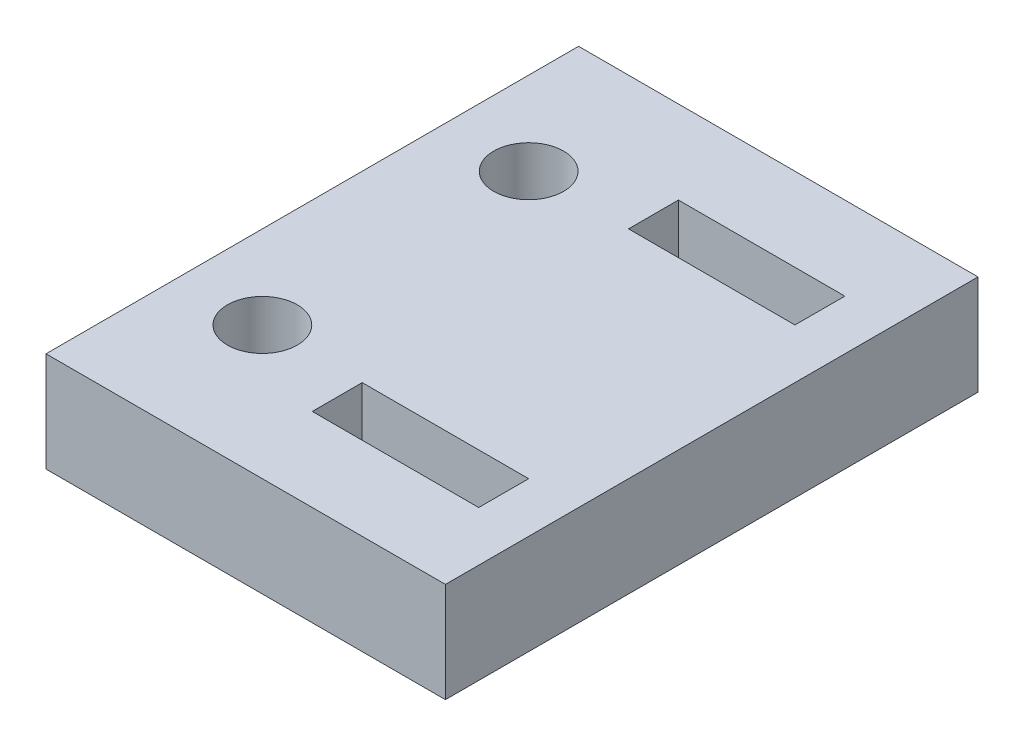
ISO-10303-21;
HEADER;
FILE_DESCRIPTION(('STEP AP214'),'2;1');
FILE_NAME('part.step','',(''),(''),'','','');
FILE_SCHEMA(('AUTOMOTIVE_DESIGN { 1 0 10303 214 1 1 1 1 }'));
ENDSEC;
DATA;
#1=APPLICATION_CONTEXT('core data for automotive mechanical design processes');
#2=APPLICATION_PROTOCOL_DEFINITION('international standard','automotive_design',2000,#1);
#3=PRODUCT_CONTEXT('',#1,'mechanical');
#4=PRODUCT('Part','Part','',(#3));
#5=PRODUCT_RELATED_PRODUCT_CATEGORY('part','',(#4));
#6=PRODUCT_DEFINITION_FORMATION('','',#4);
#7=PRODUCT_DEFINITION_CONTEXT('part definition',#1,'design');
#8=PRODUCT_DEFINITION('design','',#6,#7);
#9=PRODUCT_DEFINITION_SHAPE('','',#8);
#10=(LENGTH_UNIT() NAMED_UNIT(*) SI_UNIT(.MILLI.,.METRE.));
#11=(NAMED_UNIT(*) PLANE_ANGLE_UNIT() SI_UNIT($,.RADIAN.));
#12=(NAMED_UNIT(*) SI_UNIT($,.STERADIAN.) SOLID_ANGLE_UNIT());
#13=UNCERTAINTY_MEASURE_WITH_UNIT(LENGTH_MEASURE(1.E-05),#10,'distance_accuracy_value','');
#14=(GEOMETRIC_REPRESENTATION_CONTEXT(3) GLOBAL_UNCERTAINTY_ASSIGNED_CONTEXT((#13)) GLOBAL_UNIT_ASSIGNED_CONTEXT((#10,
#11,#12)) REPRESENTATION_CONTEXT('',''));
#15=CARTESIAN_POINT('',(0.,0.,0.));
#16=DIRECTION('',(0.,0.,1.));
#17=DIRECTION('',(1.,0.,0.));
#18=AXIS2_PLACEMENT_3D('',#15,#16,#17);
#19=CARTESIAN_POINT('',(0.,6.,0.));
#20=DIRECTION('',(0.,1.,0.));
#21=DIRECTION('',(0.,0.,1.));
#22=AXIS2_PLACEMENT_3D('',#19,#20,#21);
#23=PLANE('',#22);
#24=CARTESIAN_POINT('',(5.,6.,8.));
#25=DIRECTION('',(0.,1.,0.));
#26=DIRECTION('',(0.,0.,1.));
#27=AXIS2_PLACEMENT_3D('',#24,#25,#26);
#28=CIRCLE('',#27,2.1);
#29=CARTESIAN_POINT('',(5.,6.,10.1));
#30=VERTEX_POINT('',#29);
#31=EDGE_CURVE('E197',#30,#30,#28,.T.);
#32=ORIENTED_EDGE('',*,*,#31,.F.);
#33=EDGE_LOOP('',(#32));
#34=FACE_BOUND('',#33,.T.);
#35=DIRECTION('',(0.,0.,1.));
#36=VECTOR('',#35,1.);
#37=CARTESIAN_POINT('',(0.,6.,0.));
#38=LINE('',#37,#36);
#39=CARTESIAN_POINT('',(0.,6.,0.));
#40=VERTEX_POINT('',#39);
#41=CARTESIAN_POINT('',(0.,6.,32.));
#42=VERTEX_POINT('',#41);
#43=EDGE_CURVE('E203',#40,#42,#38,.T.);
#44=ORIENTED_EDGE('',*,*,#43,.T.);
#45=DIRECTION('',(1.,0.,0.));
#46=VECTOR('',#45,1.);
#47=CARTESIAN_POINT('',(0.,6.,32.));
#48=LINE('',#47,#46);
#49=CARTESIAN_POINT('',(24.,6.,32.));
#50=VERTEX_POINT('',#49);
#51=EDGE_CURVE('E206',#42,#50,#48,.T.);
#52=ORIENTED_EDGE('',*,*,#51,.T.);
#53=DIRECTION('',(0.,0.,-1.));
#54=VECTOR('',#53,1.);
#55=CARTESIAN_POINT('',(24.,6.,0.));
#56=LINE('',#55,#54);
#57=CARTESIAN_POINT('',(24.,6.,0.));
#58=VERTEX_POINT('',#57);
#59=EDGE_CURVE('E209',#50,#58,#56,.T.);
#60=ORIENTED_EDGE('',*,*,#59,.T.);
#61=DIRECTION('',(-1.,0.,0.));
#62=VECTOR('',#61,1.);
#63=CARTESIAN_POINT('',(0.,6.,0.));
#64=LINE('',#63,#62);
#65=EDGE_CURVE('E211',#58,#40,#64,.T.);
#66=ORIENTED_EDGE('',*,*,#65,.T.);
#67=EDGE_LOOP('',(#44,#52,#60,#66));
#68=FACE_BOUND('',#67,.T.);
#69=CARTESIAN_POINT('',(5.,6.,24.));
#70=DIRECTION('',(0.,1.,0.));
#71=DIRECTION('',(0.,0.,1.));
#72=AXIS2_PLACEMENT_3D('',#69,#70,#71);
#73=CIRCLE('',#72,2.1);
#74=CARTESIAN_POINT('',(5.,6.,26.1));
#75=VERTEX_POINT('',#74);
#76=EDGE_CURVE('E191',#75,#75,#73,.T.);
#77=ORIENTED_EDGE('',*,*,#76,.F.);
#78=EDGE_LOOP('',(#77));
#79=FACE_BOUND('',#78,.T.);
#80=DIRECTION('',(1.,0.,0.));
#81=VECTOR('',#80,1.);
#82=CARTESIAN_POINT('',(11.,6.,8.));
#83=LINE('',#82,#81);
#84=CARTESIAN_POINT('',(11.,6.,8.));
#85=VERTEX_POINT('',#84);
#86=CARTESIAN_POINT('',(21.,6.,8.));
#87=VERTEX_POINT('',#86);
#88=EDGE_CURVE('E162',#85,#87,#83,.T.);
#89=ORIENTED_EDGE('',*,*,#88,.F.);
#90=DIRECTION('',(0.,0.,1.));
#91=VECTOR('',#90,1.);
#92=CARTESIAN_POINT('',(11.,6.,5.));
#93=LINE('',#92,#91);
#94=CARTESIAN_POINT('',(11.,6.,5.));
#95=VERTEX_POINT('',#94);
#96=EDGE_CURVE('E160',#95,#85,#93,.T.);
#97=ORIENTED_EDGE('',*,*,#96,.F.);
#98=DIRECTION('',(-1.,0.,0.));
#99=VECTOR('',#98,1.);
#100=CARTESIAN_POINT('',(11.,6.,5.));
#101=LINE('',#100,#99);
#102=CARTESIAN_POINT('',(21.,6.,5.));
#103=VERTEX_POINT('',#102);
#104=EDGE_CURVE('E168',#103,#95,#101,.T.);
#105=ORIENTED_EDGE('',*,*,#104,.F.);
#106=DIRECTION('',(0.,0.,-1.));
#107=VECTOR('',#106,1.);
#108=CARTESIAN_POINT('',(21.,6.,5.));
#109=LINE('',#108,#107);
#110=EDGE_CURVE('E165',#87,#103,#109,.T.);
#111=ORIENTED_EDGE('',*,*,#110,.F.);
#112=EDGE_LOOP('',(#89,#97,#105,#111));
#113=FACE_BOUND('',#112,.T.);
#114=DIRECTION('',(1.,0.,0.));
#115=VECTOR('',#114,1.);
#116=CARTESIAN_POINT('',(11.,6.,27.));
#117=LINE('',#116,#115);
#118=CARTESIAN_POINT('',(11.,6.,27.));
#119=VERTEX_POINT('',#118);
#120=CARTESIAN_POINT('',(21.,6.,27.));
#121=VERTEX_POINT('',#120);
#122=EDGE_CURVE('E132',#119,#121,#117,.T.);
#123=ORIENTED_EDGE('',*,*,#122,.F.);
#124=DIRECTION('',(0.,0.,1.));
#125=VECTOR('',#124,1.);
#126=CARTESIAN_POINT('',(11.,6.,24.));
#127=LINE('',#126,#125);
#128=CARTESIAN_POINT('',(11.,6.,24.));
#129=VERTEX_POINT('',#128);
#130=EDGE_CURVE('E124',#129,#119,#127,.T.);
#131=ORIENTED_EDGE('',*,*,#130,.F.);
#132=DIRECTION('',(-1.,0.,0.));
#133=VECTOR('',#132,1.);
#134=CARTESIAN_POINT('',(11.,6.,24.));
#135=LINE('',#134,#133);
#136=CARTESIAN_POINT('',(21.,6.,24.));
#137=VERTEX_POINT('',#136);
#138=EDGE_CURVE('E146',#137,#129,#135,.T.);
#139=ORIENTED_EDGE('',*,*,#138,.F.);
#140=DIRECTION('',(0.,0.,-1.));
#141=VECTOR('',#140,1.);
#142=CARTESIAN_POINT('',(21.,6.,24.));
#143=LINE('',#142,#141);
#144=EDGE_CURVE('E144',#121,#137,#143,.T.);
#145=ORIENTED_EDGE('',*,*,#144,.F.);
#146=EDGE_LOOP('',(#123,#131,#139,#145));
#147=FACE_BOUND('',#146,.T.);
#148=ADVANCED_FACE('F35',(#34,#68,#79,#113,#147),#23,.T.);
#149=CARTESIAN_POINT('',(0.,0.,0.));
#150=DIRECTION('',(0.,1.,0.));
#151=DIRECTION('',(0.,0.,1.));
#152=AXIS2_PLACEMENT_3D('',#149,#150,#151);
#153=PLANE('',#152);
#154=DIRECTION('',(0.,0.,1.));
#155=VECTOR('',#154,1.);
#156=CARTESIAN_POINT('',(11.,0.,5.));
#157=LINE('',#156,#155);
#158=CARTESIAN_POINT('',(11.,0.,5.));
#159=VERTEX_POINT('',#158);
#160=CARTESIAN_POINT('',(11.,0.,8.));
#161=VERTEX_POINT('',#160);
#162=EDGE_CURVE('E140',#159,#161,#157,.T.);
#163=ORIENTED_EDGE('',*,*,#162,.T.);
#164=DIRECTION('',(1.,0.,0.));
#165=VECTOR('',#164,1.);
#166=CARTESIAN_POINT('',(11.,0.,8.));
#167=LINE('',#166,#165);
#168=CARTESIAN_POINT('',(21.,0.,8.));
#169=VERTEX_POINT('',#168);
#170=EDGE_CURVE('E173',#161,#169,#167,.T.);
#171=ORIENTED_EDGE('',*,*,#170,.T.);
#172=DIRECTION('',(0.,0.,-1.));
#173=VECTOR('',#172,1.);
#174=CARTESIAN_POINT('',(21.,0.,5.));
#175=LINE('',#174,#173);
#176=CARTESIAN_POINT('',(21.,0.,5.));
#177=VERTEX_POINT('',#176);
#178=EDGE_CURVE('E176',#169,#177,#175,.T.);
#179=ORIENTED_EDGE('',*,*,#178,.T.);
#180=DIRECTION('',(-1.,0.,0.));
#181=VECTOR('',#180,1.);
#182=CARTESIAN_POINT('',(11.,0.,5.));
#183=LINE('',#182,#181);
#184=EDGE_CURVE('E163',#177,#159,#183,.T.);
#185=ORIENTED_EDGE('',*,*,#184,.T.);
#186=EDGE_LOOP('',(#163,#171,#179,#185));
#187=FACE_BOUND('',#186,.T.);
#188=DIRECTION('',(0.,0.,1.));
#189=VECTOR('',#188,1.);
#190=CARTESIAN_POINT('',(0.,0.,0.));
#191=LINE('',#190,#189);
#192=CARTESIAN_POINT('',(0.,0.,0.));
#193=VERTEX_POINT('',#192);
#194=CARTESIAN_POINT('',(0.,0.,32.));
#195=VERTEX_POINT('',#194);
#196=EDGE_CURVE('E200',#193,#195,#191,.T.);
#197=ORIENTED_EDGE('',*,*,#196,.F.);
#198=DIRECTION('',(-1.,0.,0.));
#199=VECTOR('',#198,1.);
#200=CARTESIAN_POINT('',(0.,0.,0.));
#201=LINE('',#200,#199);
#202=CARTESIAN_POINT('',(24.,0.,0.));
#203=VERTEX_POINT('',#202);
#204=EDGE_CURVE('E207',#203,#193,#201,.T.);
#205=ORIENTED_EDGE('',*,*,#204,.F.);
#206=DIRECTION('',(0.,0.,-1.));
#207=VECTOR('',#206,1.);
#208=CARTESIAN_POINT('',(24.,0.,0.));
#209=LINE('',#208,#207);
#210=CARTESIAN_POINT('',(24.,0.,32.));
#211=VERTEX_POINT('',#210);
#212=EDGE_CURVE('E218',#211,#203,#209,.T.);
#213=ORIENTED_EDGE('',*,*,#212,.F.);
#214=DIRECTION('',(1.,0.,0.));
#215=VECTOR('',#214,1.);
#216=CARTESIAN_POINT('',(0.,0.,32.));
#217=LINE('',#216,#215);
#218=EDGE_CURVE('E216',#195,#211,#217,.T.);
#219=ORIENTED_EDGE('',*,*,#218,.F.);
#220=EDGE_LOOP('',(#197,#205,#213,#219));
#221=FACE_BOUND('',#220,.T.);
#222=CARTESIAN_POINT('',(5.,0.,8.));
#223=DIRECTION('',(0.,1.,0.));
#224=DIRECTION('',(0.,0.,1.));
#225=AXIS2_PLACEMENT_3D('',#222,#223,#224);
#226=CIRCLE('',#225,2.1);
#227=CARTESIAN_POINT('',(5.,0.,10.1));
#228=VERTEX_POINT('',#227);
#229=EDGE_CURVE('E194',#228,#228,#226,.T.);
#230=ORIENTED_EDGE('',*,*,#229,.T.);
#231=EDGE_LOOP('',(#230));
#232=FACE_BOUND('',#231,.T.);
#233=CARTESIAN_POINT('',(5.,0.,24.));
#234=DIRECTION('',(0.,1.,0.));
#235=DIRECTION('',(0.,0.,1.));
#236=AXIS2_PLACEMENT_3D('',#233,#234,#235);
#237=CIRCLE('',#236,2.1);
#238=CARTESIAN_POINT('',(5.,0.,26.1));
#239=VERTEX_POINT('',#238);
#240=EDGE_CURVE('E190',#239,#239,#237,.T.);
#241=ORIENTED_EDGE('',*,*,#240,.T.);
#242=EDGE_LOOP('',(#241));
#243=FACE_BOUND('',#242,.T.);
#244=DIRECTION('',(0.,0.,1.));
#245=VECTOR('',#244,1.);
#246=CARTESIAN_POINT('',(11.,0.,24.));
#247=LINE('',#246,#245);
#248=CARTESIAN_POINT('',(11.,0.,24.));
#249=VERTEX_POINT('',#248);
#250=CARTESIAN_POINT('',(11.,0.,27.));
#251=VERTEX_POINT('',#250);
#252=EDGE_CURVE('E58',#249,#251,#247,.T.);
#253=ORIENTED_EDGE('',*,*,#252,.T.);
#254=DIRECTION('',(1.,0.,0.));
#255=VECTOR('',#254,1.);
#256=CARTESIAN_POINT('',(11.,0.,27.));
#257=LINE('',#256,#255);
#258=CARTESIAN_POINT('',(21.,0.,27.));
#259=VERTEX_POINT('',#258);
#260=EDGE_CURVE('E139',#251,#259,#257,.T.);
#261=ORIENTED_EDGE('',*,*,#260,.T.);
#262=DIRECTION('',(0.,0.,-1.));
#263=VECTOR('',#262,1.);
#264=CARTESIAN_POINT('',(21.,0.,24.));
#265=LINE('',#264,#263);
#266=CARTESIAN_POINT('',(21.,0.,24.));
#267=VERTEX_POINT('',#266);
#268=EDGE_CURVE('E152',#259,#267,#265,.T.);
#269=ORIENTED_EDGE('',*,*,#268,.T.);
#270=DIRECTION('',(-1.,0.,0.));
#271=VECTOR('',#270,1.);
#272=CARTESIAN_POINT('',(11.,0.,24.));
#273=LINE('',#272,#271);
#274=EDGE_CURVE('E133',#267,#249,#273,.T.);
#275=ORIENTED_EDGE('',*,*,#274,.T.);
#276=EDGE_LOOP('',(#253,#261,#269,#275));
#277=FACE_BOUND('',#276,.T.);
#278=ADVANCED_FACE('F236',(#187,#221,#232,#243,#277),#153,.F.);
#279=CARTESIAN_POINT('',(0.,6.,0.));
#280=DIRECTION('',(1.,0.,0.));
#281=DIRECTION('',(0.,0.,-1.));
#282=AXIS2_PLACEMENT_3D('',#279,#280,#281);
#283=PLANE('',#282);
#284=ORIENTED_EDGE('',*,*,#196,.T.);
#285=DIRECTION('',(0.,-1.,0.));
#286=VECTOR('',#285,1.);
#287=CARTESIAN_POINT('',(0.,6.,32.));
#288=LINE('',#287,#286);
#289=EDGE_CURVE('E11',#42,#195,#288,.T.);
#290=ORIENTED_EDGE('',*,*,#289,.F.);
#291=ORIENTED_EDGE('',*,*,#43,.F.);
#292=DIRECTION('',(0.,-1.,0.));
#293=VECTOR('',#292,1.);
#294=CARTESIAN_POINT('',(0.,6.,0.));
#295=LINE('',#294,#293);
#296=EDGE_CURVE('E213',#40,#193,#295,.T.);
#297=ORIENTED_EDGE('',*,*,#296,.T.);
#298=EDGE_LOOP('',(#284,#290,#291,#297));
#299=FACE_BOUND('',#298,.T.);
#300=ADVANCED_FACE('F37',(#299),#283,.F.);
#301=CARTESIAN_POINT('',(0.,6.,32.));
#302=DIRECTION('',(0.,0.,-1.));
#303=DIRECTION('',(-1.,0.,0.));
#304=AXIS2_PLACEMENT_3D('',#301,#302,#303);
#305=PLANE('',#304);
#306=ORIENTED_EDGE('',*,*,#218,.T.);
#307=DIRECTION('',(0.,-1.,0.));
#308=VECTOR('',#307,1.);
#309=CARTESIAN_POINT('',(24.,6.,32.));
#310=LINE('',#309,#308);
#311=EDGE_CURVE('E43',#50,#211,#310,.T.);
#312=ORIENTED_EDGE('',*,*,#311,.F.);
#313=ORIENTED_EDGE('',*,*,#51,.F.);
#314=ORIENTED_EDGE('',*,*,#289,.T.);
#315=EDGE_LOOP('',(#306,#312,#313,#314));
#316=FACE_BOUND('',#315,.T.);
#317=ADVANCED_FACE('F247',(#316),#305,.F.);
#318=CARTESIAN_POINT('',(24.,6.,0.));
#319=DIRECTION('',(-1.,0.,0.));
#320=DIRECTION('',(0.,0.,1.));
#321=AXIS2_PLACEMENT_3D('',#318,#319,#320);
#322=PLANE('',#321);
#323=ORIENTED_EDGE('',*,*,#212,.T.);
#324=DIRECTION('',(0.,-1.,0.));
#325=VECTOR('',#324,1.);
#326=CARTESIAN_POINT('',(24.,6.,0.));
#327=LINE('',#326,#325);
#328=EDGE_CURVE('E223',#58,#203,#327,.T.);
#329=ORIENTED_EDGE('',*,*,#328,.F.);
#330=ORIENTED_EDGE('',*,*,#59,.F.);
#331=ORIENTED_EDGE('',*,*,#311,.T.);
#332=EDGE_LOOP('',(#323,#329,#330,#331));
#333=FACE_BOUND('',#332,.T.);
#334=ADVANCED_FACE('F230',(#333),#322,.F.);
#335=CARTESIAN_POINT('',(0.,6.,0.));
#336=DIRECTION('',(0.,0.,1.));
#337=DIRECTION('',(1.,0.,0.));
#338=AXIS2_PLACEMENT_3D('',#335,#336,#337);
#339=PLANE('',#338);
#340=ORIENTED_EDGE('',*,*,#204,.T.);
#341=ORIENTED_EDGE('',*,*,#296,.F.);
#342=ORIENTED_EDGE('',*,*,#65,.F.);
#343=ORIENTED_EDGE('',*,*,#328,.T.);
#344=EDGE_LOOP('',(#340,#341,#342,#343));
#345=FACE_BOUND('',#344,.T.);
#346=ADVANCED_FACE('F240',(#345),#339,.F.);
#347=CARTESIAN_POINT('',(5.,6.,8.));
#348=DIRECTION('',(0.,-1.,0.));
#349=DIRECTION('',(0.,0.,-1.));
#350=AXIS2_PLACEMENT_3D('',#347,#348,#349);
#351=CYLINDRICAL_SURFACE('',#350,2.1);
#352=ORIENTED_EDGE('',*,*,#31,.T.);
#353=EDGE_LOOP('',(#352));
#354=FACE_BOUND('',#353,.T.);
#355=ORIENTED_EDGE('',*,*,#229,.F.);
#356=EDGE_LOOP('',(#355));
#357=FACE_BOUND('',#356,.T.);
#358=ADVANCED_FACE('F264',(#354,#357),#351,.F.);
#359=CARTESIAN_POINT('',(5.,6.,24.));
#360=DIRECTION('',(0.,-1.,0.));
#361=DIRECTION('',(0.,0.,-1.));
#362=AXIS2_PLACEMENT_3D('',#359,#360,#361);
#363=CYLINDRICAL_SURFACE('',#362,2.1);
#364=ORIENTED_EDGE('',*,*,#76,.T.);
#365=EDGE_LOOP('',(#364));
#366=FACE_BOUND('',#365,.T.);
#367=ORIENTED_EDGE('',*,*,#240,.F.);
#368=EDGE_LOOP('',(#367));
#369=FACE_BOUND('',#368,.T.);
#370=ADVANCED_FACE('F271',(#366,#369),#363,.F.);
#371=CARTESIAN_POINT('',(11.,6.,5.));
#372=DIRECTION('',(1.,0.,0.));
#373=DIRECTION('',(0.,0.,-1.));
#374=AXIS2_PLACEMENT_3D('',#371,#372,#373);
#375=PLANE('',#374);
#376=ORIENTED_EDGE('',*,*,#162,.F.);
#377=DIRECTION('',(0.,-1.,0.));
#378=VECTOR('',#377,1.);
#379=CARTESIAN_POINT('',(11.,6.,5.));
#380=LINE('',#379,#378);
#381=EDGE_CURVE('E170',#95,#159,#380,.T.);
#382=ORIENTED_EDGE('',*,*,#381,.F.);
#383=ORIENTED_EDGE('',*,*,#96,.T.);
#384=DIRECTION('',(0.,-1.,0.));
#385=VECTOR('',#384,1.);
#386=CARTESIAN_POINT('',(11.,6.,8.));
#387=LINE('',#386,#385);
#388=EDGE_CURVE('E187',#85,#161,#387,.T.);
#389=ORIENTED_EDGE('',*,*,#388,.T.);
#390=EDGE_LOOP('',(#376,#382,#383,#389));
#391=FACE_BOUND('',#390,.T.);
#392=ADVANCED_FACE('F276',(#391),#375,.T.);
#393=CARTESIAN_POINT('',(11.,6.,8.));
#394=DIRECTION('',(0.,0.,-1.));
#395=DIRECTION('',(-1.,0.,0.));
#396=AXIS2_PLACEMENT_3D('',#393,#394,#395);
#397=PLANE('',#396);
#398=ORIENTED_EDGE('',*,*,#170,.F.);
#399=ORIENTED_EDGE('',*,*,#388,.F.);
#400=ORIENTED_EDGE('',*,*,#88,.T.);
#401=DIRECTION('',(0.,-1.,0.));
#402=VECTOR('',#401,1.);
#403=CARTESIAN_POINT('',(21.,6.,8.));
#404=LINE('',#403,#402);
#405=EDGE_CURVE('E185',#87,#169,#404,.T.);
#406=ORIENTED_EDGE('',*,*,#405,.T.);
#407=EDGE_LOOP('',(#398,#399,#400,#406));
#408=FACE_BOUND('',#407,.T.);
#409=ADVANCED_FACE('F305',(#408),#397,.T.);
#410=CARTESIAN_POINT('',(21.,6.,5.));
#411=DIRECTION('',(-1.,0.,0.));
#412=DIRECTION('',(0.,0.,1.));
#413=AXIS2_PLACEMENT_3D('',#410,#411,#412);
#414=PLANE('',#413);
#415=ORIENTED_EDGE('',*,*,#178,.F.);
#416=ORIENTED_EDGE('',*,*,#405,.F.);
#417=ORIENTED_EDGE('',*,*,#110,.T.);
#418=DIRECTION('',(0.,-1.,0.));
#419=VECTOR('',#418,1.);
#420=CARTESIAN_POINT('',(21.,6.,5.));
#421=LINE('',#420,#419);
#422=EDGE_CURVE('E183',#103,#177,#421,.T.);
#423=ORIENTED_EDGE('',*,*,#422,.T.);
#424=EDGE_LOOP('',(#415,#416,#417,#423));
#425=FACE_BOUND('',#424,.T.);
#426=ADVANCED_FACE('F301',(#425),#414,.T.);
#427=CARTESIAN_POINT('',(11.,6.,5.));
#428=DIRECTION('',(0.,0.,1.));
#429=DIRECTION('',(1.,0.,0.));
#430=AXIS2_PLACEMENT_3D('',#427,#428,#429);
#431=PLANE('',#430);
#432=ORIENTED_EDGE('',*,*,#184,.F.);
#433=ORIENTED_EDGE('',*,*,#422,.F.);
#434=ORIENTED_EDGE('',*,*,#104,.T.);
#435=ORIENTED_EDGE('',*,*,#381,.T.);
#436=EDGE_LOOP('',(#432,#433,#434,#435));
#437=FACE_BOUND('',#436,.T.);
#438=ADVANCED_FACE('F298',(#437),#431,.T.);
#439=CARTESIAN_POINT('',(11.,6.,24.));
#440=DIRECTION('',(1.,0.,0.));
#441=DIRECTION('',(0.,0.,-1.));
#442=AXIS2_PLACEMENT_3D('',#439,#440,#441);
#443=PLANE('',#442);
#444=ORIENTED_EDGE('',*,*,#252,.F.);
#445=DIRECTION('',(0.,-1.,0.));
#446=VECTOR('',#445,1.);
#447=CARTESIAN_POINT('',(11.,6.,24.));
#448=LINE('',#447,#446);
#449=EDGE_CURVE('E128',#129,#249,#448,.T.);
#450=ORIENTED_EDGE('',*,*,#449,.F.);
#451=ORIENTED_EDGE('',*,*,#130,.T.);
#452=DIRECTION('',(0.,-1.,0.));
#453=VECTOR('',#452,1.);
#454=CARTESIAN_POINT('',(11.,6.,27.));
#455=LINE('',#454,#453);
#456=EDGE_CURVE('E127',#119,#251,#455,.T.);
#457=ORIENTED_EDGE('',*,*,#456,.T.);
#458=EDGE_LOOP('',(#444,#450,#451,#457));
#459=FACE_BOUND('',#458,.T.);
#460=ADVANCED_FACE('F126',(#459),#443,.T.);
#461=CARTESIAN_POINT('',(11.,6.,27.));
#462=DIRECTION('',(0.,0.,-1.));
#463=DIRECTION('',(-1.,0.,0.));
#464=AXIS2_PLACEMENT_3D('',#461,#462,#463);
#465=PLANE('',#464);
#466=ORIENTED_EDGE('',*,*,#260,.F.);
#467=ORIENTED_EDGE('',*,*,#456,.F.);
#468=ORIENTED_EDGE('',*,*,#122,.T.);
#469=DIRECTION('',(0.,-1.,0.));
#470=VECTOR('',#469,1.);
#471=CARTESIAN_POINT('',(21.,6.,27.));
#472=LINE('',#471,#470);
#473=EDGE_CURVE('E141',#121,#259,#472,.T.);
#474=ORIENTED_EDGE('',*,*,#473,.T.);
#475=EDGE_LOOP('',(#466,#467,#468,#474));
#476=FACE_BOUND('',#475,.T.);
#477=ADVANCED_FACE('F136',(#476),#465,.T.);
#478=CARTESIAN_POINT('',(21.,6.,24.));
#479=DIRECTION('',(-1.,0.,0.));
#480=DIRECTION('',(0.,0.,1.));
#481=AXIS2_PLACEMENT_3D('',#478,#479,#480);
#482=PLANE('',#481);
#483=ORIENTED_EDGE('',*,*,#268,.F.);
#484=ORIENTED_EDGE('',*,*,#473,.F.);
#485=ORIENTED_EDGE('',*,*,#144,.T.);
#486=DIRECTION('',(0.,-1.,0.));
#487=VECTOR('',#486,1.);
#488=CARTESIAN_POINT('',(21.,6.,24.));
#489=LINE('',#488,#487);
#490=EDGE_CURVE('E50',#137,#267,#489,.T.);
#491=ORIENTED_EDGE('',*,*,#490,.T.);
#492=EDGE_LOOP('',(#483,#484,#485,#491));
#493=FACE_BOUND('',#492,.T.);
#494=ADVANCED_FACE('F286',(#493),#482,.T.);
#495=CARTESIAN_POINT('',(11.,6.,24.));
#496=DIRECTION('',(0.,0.,1.));
#497=DIRECTION('',(1.,0.,0.));
#498=AXIS2_PLACEMENT_3D('',#495,#496,#497);
#499=PLANE('',#498);
#500=ORIENTED_EDGE('',*,*,#274,.F.);
#501=ORIENTED_EDGE('',*,*,#490,.F.);
#502=ORIENTED_EDGE('',*,*,#138,.T.);
#503=ORIENTED_EDGE('',*,*,#449,.T.);
#504=EDGE_LOOP('',(#500,#501,#502,#503));
#505=FACE_BOUND('',#504,.T.);
#506=ADVANCED_FACE('F284',(#505),#499,.T.);
#507=CLOSED_SHELL('',(#148,#278,#300,#317,#334,#346,#358,#370,#392,#409,#426,#438,#460,#477,
#494,#506));
#508=MANIFOLD_SOLID_BREP('B2',#507);
#509=ADVANCED_BREP_SHAPE_REPRESENTATION('',(#18,#508),#14);
#510=SHAPE_DEFINITION_REPRESENTATION(#9,#509);
ENDSEC;
END-ISO-10303-21;
